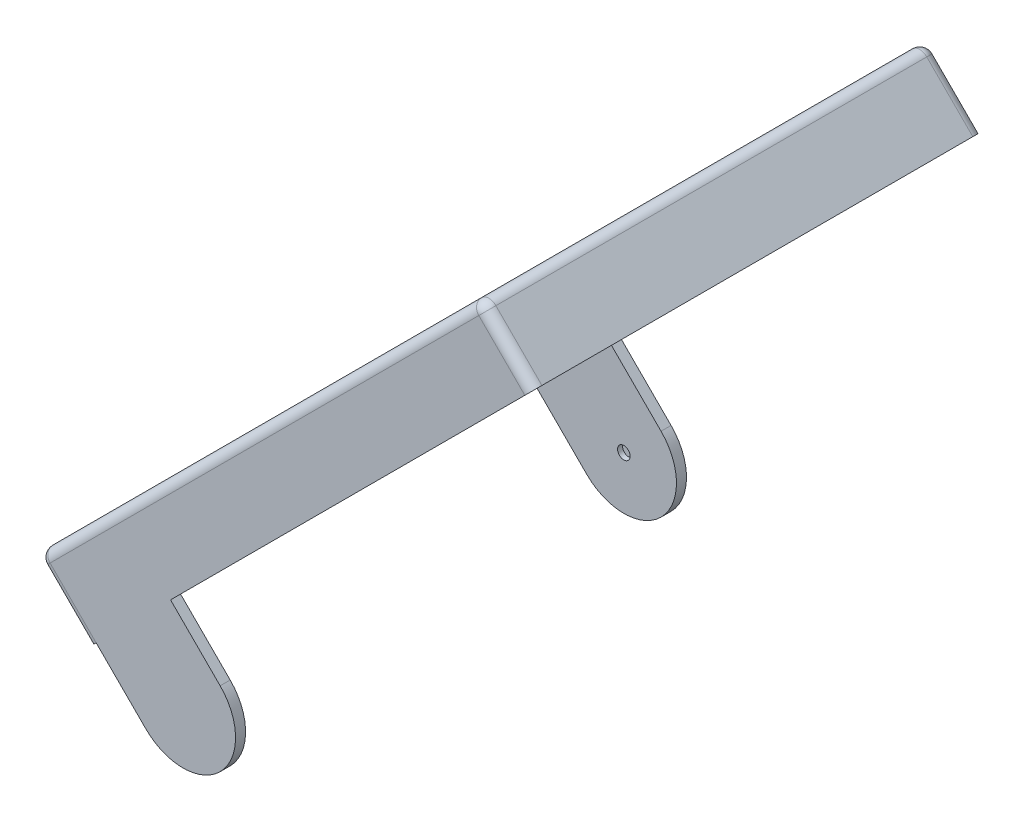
ISO-10303-21;
HEADER;
FILE_DESCRIPTION(('STEP AP214'),'2;1');
FILE_NAME('part.step','',(''),(''),'','','');
FILE_SCHEMA(('AUTOMOTIVE_DESIGN { 1 0 10303 214 1 1 1 1 }'));
ENDSEC;
DATA;
#1=APPLICATION_CONTEXT('core data for automotive mechanical design processes');
#2=APPLICATION_PROTOCOL_DEFINITION('international standard','automotive_design',2000,#1);
#3=PRODUCT_CONTEXT('',#1,'mechanical');
#4=PRODUCT('Part','Part','',(#3));
#5=PRODUCT_RELATED_PRODUCT_CATEGORY('part','',(#4));
#6=PRODUCT_DEFINITION_FORMATION('','',#4);
#7=PRODUCT_DEFINITION_CONTEXT('part definition',#1,'design');
#8=PRODUCT_DEFINITION('design','',#6,#7);
#9=PRODUCT_DEFINITION_SHAPE('','',#8);
#10=(LENGTH_UNIT() NAMED_UNIT(*) SI_UNIT(.MILLI.,.METRE.));
#11=(NAMED_UNIT(*) PLANE_ANGLE_UNIT() SI_UNIT($,.RADIAN.));
#12=(NAMED_UNIT(*) SI_UNIT($,.STERADIAN.) SOLID_ANGLE_UNIT());
#13=UNCERTAINTY_MEASURE_WITH_UNIT(LENGTH_MEASURE(1.E-05),#10,'distance_accuracy_value','');
#14=(GEOMETRIC_REPRESENTATION_CONTEXT(3) GLOBAL_UNCERTAINTY_ASSIGNED_CONTEXT((#13)) GLOBAL_UNIT_ASSIGNED_CONTEXT((#10,
#11,#12)) REPRESENTATION_CONTEXT('',''));
#15=CARTESIAN_POINT('',(0.,0.,0.));
#16=DIRECTION('',(0.,0.,1.));
#17=DIRECTION('',(1.,0.,0.));
#18=AXIS2_PLACEMENT_3D('',#15,#16,#17);
#19=CARTESIAN_POINT('',(20.6500179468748,105.449007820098,-45.));
#20=DIRECTION('',(-0.707106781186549,0.707106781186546,0.));
#21=DIRECTION('',(0.,0.,1.));
#22=AXIS2_PLACEMENT_3D('',#19,#20,#21);
#23=PLANE('',#22);
#24=DIRECTION('',(0.,0.,-1.));
#25=VECTOR('',#24,1.);
#26=CARTESIAN_POINT('',(-66.3241161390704,18.4748737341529,-43.));
#27=LINE('',#26,#25);
#28=CARTESIAN_POINT('',(-66.3241161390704,18.4748737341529,-43.));
#29=VERTEX_POINT('',#28);
#30=CARTESIAN_POINT('',(-66.3241161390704,18.4748737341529,-45.));
#31=VERTEX_POINT('',#30);
#32=EDGE_CURVE('E246',#29,#31,#27,.T.);
#33=ORIENTED_EDGE('',*,*,#32,.F.);
#34=DIRECTION('',(0.,0.,1.));
#35=VECTOR('',#34,1.);
#36=CARTESIAN_POINT('',(-66.3241161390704,18.4748737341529,45.));
#37=LINE('',#36,#35);
#38=CARTESIAN_POINT('',(-66.3241161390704,18.4748737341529,43.));
#39=VERTEX_POINT('',#38);
#40=EDGE_CURVE('E311',#29,#39,#37,.T.);
#41=ORIENTED_EDGE('',*,*,#40,.T.);
#42=DIRECTION('',(0.,0.,1.));
#43=VECTOR('',#42,1.);
#44=CARTESIAN_POINT('',(-66.3241161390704,18.4748737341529,43.));
#45=LINE('',#44,#43);
#46=CARTESIAN_POINT('',(-66.3241161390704,18.4748737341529,45.));
#47=VERTEX_POINT('',#46);
#48=EDGE_CURVE('E289',#39,#47,#45,.T.);
#49=ORIENTED_EDGE('',*,*,#48,.T.);
#50=CARTESIAN_POINT('',(-66.3241161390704,18.4748737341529,43.));
#51=DIRECTION('',(-0.707106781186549,0.707106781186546,0.));
#52=DIRECTION('',(0.,0.,1.));
#53=AXIS2_PLACEMENT_3D('',#50,#51,#52);
#54=CIRCLE('',#53,2.);
#55=CARTESIAN_POINT('',(-67.7383297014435,17.0606601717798,43.));
#56=VERTEX_POINT('',#55);
#57=EDGE_CURVE('E360',#47,#56,#54,.F.);
#58=ORIENTED_EDGE('',*,*,#57,.T.);
#59=DIRECTION('',(0.,0.,1.));
#60=VECTOR('',#59,1.);
#61=CARTESIAN_POINT('',(-67.7383297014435,17.0606601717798,45.));
#62=LINE('',#61,#60);
#63=CARTESIAN_POINT('',(-67.7383297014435,17.0606601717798,-43.));
#64=VERTEX_POINT('',#63);
#65=EDGE_CURVE('E343',#64,#56,#62,.T.);
#66=ORIENTED_EDGE('',*,*,#65,.F.);
#67=CARTESIAN_POINT('',(-66.3241161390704,18.4748737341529,-43.));
#68=DIRECTION('',(-0.707106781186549,0.707106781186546,0.));
#69=DIRECTION('',(0.,0.,1.));
#70=AXIS2_PLACEMENT_3D('',#67,#68,#69);
#71=CIRCLE('',#70,2.);
#72=EDGE_CURVE('E362',#64,#31,#71,.F.);
#73=ORIENTED_EDGE('',*,*,#72,.T.);
#74=EDGE_LOOP('',(#33,#41,#49,#58,#66,#73));
#75=FACE_BOUND('',#74,.T.);
#76=ADVANCED_FACE('F34',(#75),#23,.F.);
#77=DIRECTION('',(0.,0.,-1.));
#78=VECTOR('',#77,1.);
#79=CARTESIAN_POINT('',(-51.4748737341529,33.3241161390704,-43.));
#80=LINE('',#79,#78);
#81=CARTESIAN_POINT('',(-51.4748737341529,33.3241161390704,-43.));
#82=VERTEX_POINT('',#81);
#83=CARTESIAN_POINT('',(-51.4748737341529,33.3241161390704,-45.));
#84=VERTEX_POINT('',#83);
#85=EDGE_CURVE('E57',#82,#84,#80,.T.);
#86=ORIENTED_EDGE('',*,*,#85,.T.);
#87=DIRECTION('',(-0.707106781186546,-0.707106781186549,0.));
#88=VECTOR('',#87,1.);
#89=CARTESIAN_POINT('',(-67.7383297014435,17.0606601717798,-45.));
#90=LINE('',#89,#88);
#91=CARTESIAN_POINT('',(19.2358043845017,104.034794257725,-45.));
#92=VERTEX_POINT('',#91);
#93=EDGE_CURVE('E341',#92,#84,#90,.T.);
#94=ORIENTED_EDGE('',*,*,#93,.F.);
#95=CARTESIAN_POINT('',(19.2358043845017,104.034794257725,-43.));
#96=DIRECTION('',(-0.707106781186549,0.707106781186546,0.));
#97=DIRECTION('',(0.,0.,1.));
#98=AXIS2_PLACEMENT_3D('',#95,#96,#97);
#99=CIRCLE('',#98,2.);
#100=CARTESIAN_POINT('',(20.6500179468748,105.449007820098,-43.));
#101=VERTEX_POINT('',#100);
#102=EDGE_CURVE('E358',#92,#101,#99,.F.);
#103=ORIENTED_EDGE('',*,*,#102,.T.);
#104=DIRECTION('',(0.,0.,-1.));
#105=VECTOR('',#104,1.);
#106=CARTESIAN_POINT('',(20.6500179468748,105.449007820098,45.));
#107=LINE('',#106,#105);
#108=CARTESIAN_POINT('',(20.6500179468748,105.449007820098,43.));
#109=VERTEX_POINT('',#108);
#110=EDGE_CURVE('E347',#109,#101,#107,.T.);
#111=ORIENTED_EDGE('',*,*,#110,.F.);
#112=CARTESIAN_POINT('',(19.2358043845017,104.034794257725,43.));
#113=DIRECTION('',(-0.707106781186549,0.707106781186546,0.));
#114=DIRECTION('',(0.,0.,1.));
#115=AXIS2_PLACEMENT_3D('',#112,#113,#114);
#116=CIRCLE('',#115,2.);
#117=CARTESIAN_POINT('',(19.2358043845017,104.034794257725,45.));
#118=VERTEX_POINT('',#117);
#119=EDGE_CURVE('E355',#109,#118,#116,.F.);
#120=ORIENTED_EDGE('',*,*,#119,.T.);
#121=DIRECTION('',(0.707106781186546,0.707106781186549,0.));
#122=VECTOR('',#121,1.);
#123=CARTESIAN_POINT('',(-67.7383297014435,17.0606601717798,45.));
#124=LINE('',#123,#122);
#125=CARTESIAN_POINT('',(-51.4748737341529,33.3241161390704,45.));
#126=VERTEX_POINT('',#125);
#127=EDGE_CURVE('E285',#126,#118,#124,.T.);
#128=ORIENTED_EDGE('',*,*,#127,.F.);
#129=DIRECTION('',(0.,0.,1.));
#130=VECTOR('',#129,1.);
#131=CARTESIAN_POINT('',(-51.4748737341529,33.3241161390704,43.));
#132=LINE('',#131,#130);
#133=CARTESIAN_POINT('',(-51.4748737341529,33.3241161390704,43.));
#134=VERTEX_POINT('',#133);
#135=EDGE_CURVE('E281',#134,#126,#132,.T.);
#136=ORIENTED_EDGE('',*,*,#135,.F.);
#137=DIRECTION('',(0.707106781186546,0.707106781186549,0.));
#138=VECTOR('',#137,1.);
#139=CARTESIAN_POINT('',(-67.7383297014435,17.0606601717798,43.));
#140=LINE('',#139,#138);
#141=CARTESIAN_POINT('',(19.2358043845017,104.034794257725,43.));
#142=VERTEX_POINT('',#141);
#143=EDGE_CURVE('E308',#134,#142,#140,.T.);
#144=ORIENTED_EDGE('',*,*,#143,.T.);
#145=DIRECTION('',(0.,0.,-1.));
#146=VECTOR('',#145,1.);
#147=CARTESIAN_POINT('',(19.2358043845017,104.034794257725,45.));
#148=LINE('',#147,#146);
#149=CARTESIAN_POINT('',(19.2358043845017,104.034794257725,-43.));
#150=VERTEX_POINT('',#149);
#151=EDGE_CURVE('E310',#142,#150,#148,.T.);
#152=ORIENTED_EDGE('',*,*,#151,.T.);
#153=DIRECTION('',(-0.707106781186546,-0.707106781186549,0.));
#154=VECTOR('',#153,1.);
#155=CARTESIAN_POINT('',(-67.7383297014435,17.0606601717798,-43.));
#156=LINE('',#155,#154);
#157=EDGE_CURVE('E284',#150,#82,#156,.T.);
#158=ORIENTED_EDGE('',*,*,#157,.T.);
#159=EDGE_LOOP('',(#86,#94,#103,#111,#120,#128,#136,#144,#152,#158));
#160=FACE_BOUND('',#159,.T.);
#161=ADVANCED_FACE('F458',(#160),#23,.F.);
#162=CARTESIAN_POINT('',(-78.3449314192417,27.667261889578,-45.));
#163=DIRECTION('',(0.,0.,1.));
#164=DIRECTION('',(0.707106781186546,0.707106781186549,0.));
#165=AXIS2_PLACEMENT_3D('',#162,#163,#164);
#166=PLANE('',#165);
#167=DIRECTION('',(0.707106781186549,-0.707106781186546,0.));
#168=VECTOR('',#167,1.);
#169=CARTESIAN_POINT('',(-76.9307178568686,29.0814754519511,-45.));
#170=LINE('',#169,#168);
#171=CARTESIAN_POINT('',(-75.5165042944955,27.667261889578,-45.));
#172=VERTEX_POINT('',#171);
#173=EDGE_CURVE('E366',#31,#172,#170,.F.);
#174=ORIENTED_EDGE('',*,*,#173,.T.);
#175=DIRECTION('',(-0.707106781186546,-0.707106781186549,0.));
#176=VECTOR('',#175,1.);
#177=CARTESIAN_POINT('',(10.0434162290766,113.22718241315,-45.));
#178=LINE('',#177,#176);
#179=CARTESIAN_POINT('',(10.0434162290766,113.22718241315,-45.));
#180=VERTEX_POINT('',#179);
#181=EDGE_CURVE('E394',#172,#180,#178,.F.);
#182=ORIENTED_EDGE('',*,*,#181,.T.);
#183=DIRECTION('',(0.707106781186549,-0.707106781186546,0.));
#184=VECTOR('',#183,1.);
#185=CARTESIAN_POINT('',(8.62920266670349,114.641395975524,-45.));
#186=LINE('',#185,#184);
#187=EDGE_CURVE('E364',#180,#92,#186,.T.);
#188=ORIENTED_EDGE('',*,*,#187,.T.);
#189=ORIENTED_EDGE('',*,*,#93,.T.);
#190=DIRECTION('',(-0.707106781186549,0.707106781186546,0.));
#191=VECTOR('',#190,1.);
#192=CARTESIAN_POINT('',(-41.5753787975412,23.4246212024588,-45.));
#193=LINE('',#192,#191);
#194=CARTESIAN_POINT('',(-41.5753787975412,23.4246212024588,-45.));
#195=VERTEX_POINT('',#194);
#196=EDGE_CURVE('E232',#195,#84,#193,.T.);
#197=ORIENTED_EDGE('',*,*,#196,.F.);
#198=CARTESIAN_POINT('',(-49.,16.,-45.));
#199=DIRECTION('',(0.,0.,1.));
#200=DIRECTION('',(0.707106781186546,0.707106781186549,0.));
#201=AXIS2_PLACEMENT_3D('',#198,#199,#200);
#202=CIRCLE('',#201,10.5);
#203=CARTESIAN_POINT('',(-56.4246212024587,8.57537879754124,-45.));
#204=VERTEX_POINT('',#203);
#205=EDGE_CURVE('E235',#204,#195,#202,.T.);
#206=ORIENTED_EDGE('',*,*,#205,.F.);
#207=DIRECTION('',(0.707106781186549,-0.707106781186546,0.));
#208=VECTOR('',#207,1.);
#209=CARTESIAN_POINT('',(-66.3241161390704,18.4748737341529,-45.));
#210=LINE('',#209,#208);
#211=EDGE_CURVE('E237',#31,#204,#210,.T.);
#212=ORIENTED_EDGE('',*,*,#211,.F.);
#213=EDGE_LOOP('',(#174,#182,#188,#189,#197,#206,#212));
#214=FACE_BOUND('',#213,.T.);
#215=ADVANCED_FACE('F36',(#214),#166,.F.);
#216=CARTESIAN_POINT('',(-78.3449314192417,27.667261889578,45.));
#217=DIRECTION('',(0.707106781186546,0.707106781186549,0.));
#218=DIRECTION('',(0.,0.,-1.));
#219=AXIS2_PLACEMENT_3D('',#216,#217,#218);
#220=PLANE('',#219);
#221=DIRECTION('',(0.707106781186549,-0.707106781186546,0.));
#222=VECTOR('',#221,1.);
#223=CARTESIAN_POINT('',(-78.3449314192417,27.667261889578,43.));
#224=LINE('',#223,#222);
#225=CARTESIAN_POINT('',(-76.9307178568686,26.2530483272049,43.));
#226=VERTEX_POINT('',#225);
#227=EDGE_CURVE('E350',#56,#226,#224,.F.);
#228=ORIENTED_EDGE('',*,*,#227,.T.);
#229=DIRECTION('',(0.,0.,1.));
#230=VECTOR('',#229,1.);
#231=CARTESIAN_POINT('',(-76.9307178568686,26.2530483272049,-43.));
#232=LINE('',#231,#230);
#233=CARTESIAN_POINT('',(-76.9307178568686,26.2530483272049,-43.));
#234=VERTEX_POINT('',#233);
#235=EDGE_CURVE('E390',#226,#234,#232,.F.);
#236=ORIENTED_EDGE('',*,*,#235,.T.);
#237=DIRECTION('',(0.707106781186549,-0.707106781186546,0.));
#238=VECTOR('',#237,1.);
#239=CARTESIAN_POINT('',(-78.3449314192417,27.667261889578,-43.));
#240=LINE('',#239,#238);
#241=EDGE_CURVE('E353',#234,#64,#240,.T.);
#242=ORIENTED_EDGE('',*,*,#241,.T.);
#243=ORIENTED_EDGE('',*,*,#65,.T.);
#244=EDGE_LOOP('',(#228,#236,#242,#243));
#245=FACE_BOUND('',#244,.T.);
#246=ADVANCED_FACE('F435',(#245),#220,.F.);
#247=CARTESIAN_POINT('',(-78.3449314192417,27.667261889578,45.));
#248=DIRECTION('',(0.,0.,-1.));
#249=DIRECTION('',(-0.707106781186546,-0.707106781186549,0.));
#250=AXIS2_PLACEMENT_3D('',#247,#248,#249);
#251=PLANE('',#250);
#252=DIRECTION('',(0.707106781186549,-0.707106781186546,0.));
#253=VECTOR('',#252,1.);
#254=CARTESIAN_POINT('',(8.62920266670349,114.641395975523,45.));
#255=LINE('',#254,#253);
#256=CARTESIAN_POINT('',(10.0434162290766,113.22718241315,45.));
#257=VERTEX_POINT('',#256);
#258=EDGE_CURVE('E369',#118,#257,#255,.F.);
#259=ORIENTED_EDGE('',*,*,#258,.T.);
#260=DIRECTION('',(0.707106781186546,0.707106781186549,0.));
#261=VECTOR('',#260,1.);
#262=CARTESIAN_POINT('',(-75.5165042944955,27.667261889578,45.));
#263=LINE('',#262,#261);
#264=CARTESIAN_POINT('',(-75.5165042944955,27.667261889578,45.));
#265=VERTEX_POINT('',#264);
#266=EDGE_CURVE('E297',#257,#265,#263,.F.);
#267=ORIENTED_EDGE('',*,*,#266,.T.);
#268=DIRECTION('',(0.707106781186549,-0.707106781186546,0.));
#269=VECTOR('',#268,1.);
#270=CARTESIAN_POINT('',(-76.9307178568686,29.0814754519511,45.));
#271=LINE('',#270,#269);
#272=EDGE_CURVE('E371',#265,#47,#271,.T.);
#273=ORIENTED_EDGE('',*,*,#272,.T.);
#274=DIRECTION('',(0.707106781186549,-0.707106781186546,0.));
#275=VECTOR('',#274,1.);
#276=CARTESIAN_POINT('',(-66.3241161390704,18.4748737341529,45.));
#277=LINE('',#276,#275);
#278=CARTESIAN_POINT('',(-56.4246212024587,8.57537879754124,45.));
#279=VERTEX_POINT('',#278);
#280=EDGE_CURVE('E262',#47,#279,#277,.T.);
#281=ORIENTED_EDGE('',*,*,#280,.T.);
#282=CARTESIAN_POINT('',(-49.,16.,45.));
#283=DIRECTION('',(0.,0.,1.));
#284=DIRECTION('',(0.707106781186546,0.707106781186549,0.));
#285=AXIS2_PLACEMENT_3D('',#282,#283,#284);
#286=CIRCLE('',#285,10.5);
#287=CARTESIAN_POINT('',(-41.5753787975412,23.4246212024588,45.));
#288=VERTEX_POINT('',#287);
#289=EDGE_CURVE('E265',#279,#288,#286,.T.);
#290=ORIENTED_EDGE('',*,*,#289,.T.);
#291=DIRECTION('',(-0.707106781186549,0.707106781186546,0.));
#292=VECTOR('',#291,1.);
#293=CARTESIAN_POINT('',(-41.5753787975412,23.4246212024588,45.));
#294=LINE('',#293,#292);
#295=EDGE_CURVE('E268',#288,#126,#294,.T.);
#296=ORIENTED_EDGE('',*,*,#295,.T.);
#297=ORIENTED_EDGE('',*,*,#127,.T.);
#298=EDGE_LOOP('',(#259,#267,#273,#281,#290,#296,#297));
#299=FACE_BOUND('',#298,.T.);
#300=ADVANCED_FACE('F446',(#299),#251,.F.);
#301=CARTESIAN_POINT('',(10.0434162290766,116.055609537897,45.));
#302=DIRECTION('',(-0.707106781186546,-0.707106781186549,0.));
#303=DIRECTION('',(0.,0.,1.));
#304=AXIS2_PLACEMENT_3D('',#301,#302,#303);
#305=PLANE('',#304);
#306=DIRECTION('',(0.707106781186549,-0.707106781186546,0.));
#307=VECTOR('',#306,1.);
#308=CARTESIAN_POINT('',(10.0434162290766,116.055609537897,-43.));
#309=LINE('',#308,#307);
#310=CARTESIAN_POINT('',(11.4576297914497,114.641395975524,-43.));
#311=VERTEX_POINT('',#310);
#312=EDGE_CURVE('E375',#101,#311,#309,.F.);
#313=ORIENTED_EDGE('',*,*,#312,.T.);
#314=DIRECTION('',(0.,0.,-1.));
#315=VECTOR('',#314,1.);
#316=CARTESIAN_POINT('',(11.4576297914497,114.641395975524,43.));
#317=LINE('',#316,#315);
#318=CARTESIAN_POINT('',(11.4576297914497,114.641395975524,43.));
#319=VERTEX_POINT('',#318);
#320=EDGE_CURVE('E305',#311,#319,#317,.F.);
#321=ORIENTED_EDGE('',*,*,#320,.T.);
#322=DIRECTION('',(0.707106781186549,-0.707106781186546,0.));
#323=VECTOR('',#322,1.);
#324=CARTESIAN_POINT('',(10.0434162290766,116.055609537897,43.));
#325=LINE('',#324,#323);
#326=EDGE_CURVE('E373',#319,#109,#325,.T.);
#327=ORIENTED_EDGE('',*,*,#326,.T.);
#328=ORIENTED_EDGE('',*,*,#110,.T.);
#329=EDGE_LOOP('',(#313,#321,#327,#328));
#330=FACE_BOUND('',#329,.T.);
#331=ADVANCED_FACE('F400',(#330),#305,.F.);
#332=CARTESIAN_POINT('',(10.0434162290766,116.055609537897,-45.));
#333=DIRECTION('',(-0.707106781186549,0.707106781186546,0.));
#334=DIRECTION('',(0.,0.,1.));
#335=AXIS2_PLACEMENT_3D('',#332,#333,#334);
#336=PLANE('',#335);
#337=DIRECTION('',(-0.707106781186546,-0.707106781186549,0.));
#338=VECTOR('',#337,1.);
#339=CARTESIAN_POINT('',(-76.9307178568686,29.0814754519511,-43.));
#340=LINE('',#339,#338);
#341=CARTESIAN_POINT('',(8.62920266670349,114.641395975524,-43.));
#342=VERTEX_POINT('',#341);
#343=CARTESIAN_POINT('',(-76.9307178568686,29.0814754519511,-43.));
#344=VERTEX_POINT('',#343);
#345=EDGE_CURVE('E385',#342,#344,#340,.T.);
#346=ORIENTED_EDGE('',*,*,#345,.T.);
#347=DIRECTION('',(0.,0.,1.));
#348=VECTOR('',#347,1.);
#349=CARTESIAN_POINT('',(-76.9307178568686,29.0814754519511,43.));
#350=LINE('',#349,#348);
#351=CARTESIAN_POINT('',(-76.9307178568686,29.0814754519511,43.));
#352=VERTEX_POINT('',#351);
#353=EDGE_CURVE('E387',#344,#352,#350,.T.);
#354=ORIENTED_EDGE('',*,*,#353,.T.);
#355=DIRECTION('',(0.707106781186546,0.707106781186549,0.));
#356=VECTOR('',#355,1.);
#357=CARTESIAN_POINT('',(8.62920266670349,114.641395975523,43.));
#358=LINE('',#357,#356);
#359=CARTESIAN_POINT('',(8.62920266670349,114.641395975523,43.));
#360=VERTEX_POINT('',#359);
#361=EDGE_CURVE('E381',#352,#360,#358,.T.);
#362=ORIENTED_EDGE('',*,*,#361,.T.);
#363=DIRECTION('',(0.,0.,-1.));
#364=VECTOR('',#363,1.);
#365=CARTESIAN_POINT('',(8.62920266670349,114.641395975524,-43.));
#366=LINE('',#365,#364);
#367=EDGE_CURVE('E383',#360,#342,#366,.T.);
#368=ORIENTED_EDGE('',*,*,#367,.T.);
#369=EDGE_LOOP('',(#346,#354,#362,#368));
#370=FACE_BOUND('',#369,.T.);
#371=ADVANCED_FACE('F474',(#370),#336,.T.);
#372=CARTESIAN_POINT('',(-76.9307178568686,29.0814754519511,-43.));
#373=DIRECTION('',(0.707106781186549,-0.707106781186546,0.));
#374=DIRECTION('',(0.,0.,-1.));
#375=AXIS2_PLACEMENT_3D('',#372,#373,#374);
#376=CYLINDRICAL_SURFACE('',#375,2.);
#377=ORIENTED_EDGE('',*,*,#241,.F.);
#378=CARTESIAN_POINT('',(-75.5165042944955,27.667261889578,-43.));
#379=DIRECTION('',(0.707106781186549,-0.707106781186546,0.));
#380=DIRECTION('',(0.,0.,-1.));
#381=AXIS2_PLACEMENT_3D('',#378,#379,#380);
#382=CIRCLE('',#381,2.);
#383=EDGE_CURVE('E392',#234,#172,#382,.T.);
#384=ORIENTED_EDGE('',*,*,#383,.T.);
#385=ORIENTED_EDGE('',*,*,#173,.F.);
#386=ORIENTED_EDGE('',*,*,#72,.F.);
#387=EDGE_LOOP('',(#377,#384,#385,#386));
#388=FACE_BOUND('',#387,.T.);
#389=ADVANCED_FACE('F476',(#388),#376,.T.);
#390=CARTESIAN_POINT('',(-76.9307178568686,29.0814754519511,43.));
#391=DIRECTION('',(0.707106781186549,-0.707106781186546,0.));
#392=DIRECTION('',(0.,0.,-1.));
#393=AXIS2_PLACEMENT_3D('',#390,#391,#392);
#394=CYLINDRICAL_SURFACE('',#393,2.);
#395=ORIENTED_EDGE('',*,*,#272,.F.);
#396=CARTESIAN_POINT('',(-75.5165042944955,27.667261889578,43.));
#397=DIRECTION('',(0.707106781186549,-0.707106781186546,0.));
#398=DIRECTION('',(0.,0.,-1.));
#399=AXIS2_PLACEMENT_3D('',#396,#397,#398);
#400=CIRCLE('',#399,2.);
#401=EDGE_CURVE('E378',#265,#226,#400,.T.);
#402=ORIENTED_EDGE('',*,*,#401,.T.);
#403=ORIENTED_EDGE('',*,*,#227,.F.);
#404=ORIENTED_EDGE('',*,*,#57,.F.);
#405=EDGE_LOOP('',(#395,#402,#403,#404));
#406=FACE_BOUND('',#405,.T.);
#407=ADVANCED_FACE('F433',(#406),#394,.T.);
#408=CARTESIAN_POINT('',(8.62920266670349,114.641395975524,-43.));
#409=DIRECTION('',(0.707106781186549,-0.707106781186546,0.));
#410=DIRECTION('',(0.,0.,-1.));
#411=AXIS2_PLACEMENT_3D('',#408,#409,#410);
#412=CYLINDRICAL_SURFACE('',#411,2.);
#413=ORIENTED_EDGE('',*,*,#187,.F.);
#414=CARTESIAN_POINT('',(10.0434162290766,113.22718241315,-43.));
#415=DIRECTION('',(0.707106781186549,-0.707106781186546,0.));
#416=DIRECTION('',(0.,0.,-1.));
#417=AXIS2_PLACEMENT_3D('',#414,#415,#416);
#418=CIRCLE('',#417,2.);
#419=EDGE_CURVE('E396',#180,#311,#418,.T.);
#420=ORIENTED_EDGE('',*,*,#419,.T.);
#421=ORIENTED_EDGE('',*,*,#312,.F.);
#422=ORIENTED_EDGE('',*,*,#102,.F.);
#423=EDGE_LOOP('',(#413,#420,#421,#422));
#424=FACE_BOUND('',#423,.T.);
#425=ADVANCED_FACE('F463',(#424),#412,.T.);
#426=CARTESIAN_POINT('',(8.62920266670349,114.641395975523,43.));
#427=DIRECTION('',(0.707106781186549,-0.707106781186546,0.));
#428=DIRECTION('',(0.,0.,-1.));
#429=AXIS2_PLACEMENT_3D('',#426,#427,#428);
#430=CYLINDRICAL_SURFACE('',#429,2.);
#431=ORIENTED_EDGE('',*,*,#326,.F.);
#432=CARTESIAN_POINT('',(10.0434162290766,113.22718241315,43.));
#433=DIRECTION('',(0.707106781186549,-0.707106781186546,0.));
#434=DIRECTION('',(0.,0.,-1.));
#435=AXIS2_PLACEMENT_3D('',#432,#433,#434);
#436=CIRCLE('',#435,2.);
#437=EDGE_CURVE('E298',#319,#257,#436,.T.);
#438=ORIENTED_EDGE('',*,*,#437,.T.);
#439=ORIENTED_EDGE('',*,*,#258,.F.);
#440=ORIENTED_EDGE('',*,*,#119,.F.);
#441=EDGE_LOOP('',(#431,#438,#439,#440));
#442=FACE_BOUND('',#441,.T.);
#443=ADVANCED_FACE('F407',(#442),#430,.T.);
#444=CARTESIAN_POINT('',(10.0434162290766,113.22718241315,-43.));
#445=DIRECTION('',(0.,0.,1.));
#446=DIRECTION('',(0.707106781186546,0.707106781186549,0.));
#447=AXIS2_PLACEMENT_3D('',#444,#445,#446);
#448=SPHERICAL_SURFACE('',#447,2.);
#449=CARTESIAN_POINT('',(10.0434162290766,113.22718241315,-43.));
#450=DIRECTION('',(0.,0.,1.));
#451=DIRECTION('',(0.707106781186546,0.707106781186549,0.));
#452=AXIS2_PLACEMENT_3D('',#449,#450,#451);
#453=CIRCLE('',#452,2.);
#454=EDGE_CURVE('E335',#311,#342,#453,.T.);
#455=ORIENTED_EDGE('',*,*,#454,.F.);
#456=ORIENTED_EDGE('',*,*,#419,.F.);
#457=CARTESIAN_POINT('',(10.0434162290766,113.22718241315,-43.));
#458=DIRECTION('',(-0.707106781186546,-0.707106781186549,0.));
#459=DIRECTION('',(0.,0.,1.));
#460=AXIS2_PLACEMENT_3D('',#457,#458,#459);
#461=CIRCLE('',#460,2.);
#462=EDGE_CURVE('E338',#342,#180,#461,.T.);
#463=ORIENTED_EDGE('',*,*,#462,.F.);
#464=EDGE_LOOP('',(#455,#456,#463));
#465=FACE_BOUND('',#464,.T.);
#466=ADVANCED_FACE('F467',(#465),#448,.T.);
#467=CARTESIAN_POINT('',(11.4576297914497,114.641395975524,-43.));
#468=DIRECTION('',(0.707106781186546,0.707106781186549,0.));
#469=DIRECTION('',(0.,0.,-1.));
#470=AXIS2_PLACEMENT_3D('',#467,#468,#469);
#471=CYLINDRICAL_SURFACE('',#470,2.);
#472=ORIENTED_EDGE('',*,*,#462,.T.);
#473=ORIENTED_EDGE('',*,*,#181,.F.);
#474=CARTESIAN_POINT('',(-75.5165042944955,27.667261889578,-43.));
#475=DIRECTION('',(-0.707106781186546,-0.707106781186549,0.));
#476=DIRECTION('',(0.,0.,1.));
#477=AXIS2_PLACEMENT_3D('',#474,#475,#476);
#478=CIRCLE('',#477,2.);
#479=EDGE_CURVE('E332',#344,#172,#478,.T.);
#480=ORIENTED_EDGE('',*,*,#479,.F.);
#481=ORIENTED_EDGE('',*,*,#345,.F.);
#482=EDGE_LOOP('',(#472,#473,#480,#481));
#483=FACE_BOUND('',#482,.T.);
#484=ADVANCED_FACE('F471',(#483),#471,.T.);
#485=CARTESIAN_POINT('',(10.0434162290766,113.22718241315,-45.));
#486=DIRECTION('',(0.,0.,1.));
#487=DIRECTION('',(0.707106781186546,0.707106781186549,0.));
#488=AXIS2_PLACEMENT_3D('',#485,#486,#487);
#489=CYLINDRICAL_SURFACE('',#488,2.);
#490=ORIENTED_EDGE('',*,*,#454,.T.);
#491=ORIENTED_EDGE('',*,*,#367,.F.);
#492=CARTESIAN_POINT('',(10.0434162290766,113.22718241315,43.));
#493=DIRECTION('',(0.,0.,1.));
#494=DIRECTION('',(0.707106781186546,0.707106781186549,0.));
#495=AXIS2_PLACEMENT_3D('',#492,#493,#494);
#496=CIRCLE('',#495,2.);
#497=EDGE_CURVE('E329',#319,#360,#496,.T.);
#498=ORIENTED_EDGE('',*,*,#497,.F.);
#499=ORIENTED_EDGE('',*,*,#320,.F.);
#500=EDGE_LOOP('',(#490,#491,#498,#499));
#501=FACE_BOUND('',#500,.T.);
#502=ADVANCED_FACE('F412',(#501),#489,.T.);
#503=CARTESIAN_POINT('',(-75.5165042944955,27.667261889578,-43.));
#504=DIRECTION('',(0.,0.,1.));
#505=DIRECTION('',(0.707106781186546,0.707106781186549,0.));
#506=AXIS2_PLACEMENT_3D('',#503,#504,#505);
#507=SPHERICAL_SURFACE('',#506,2.);
#508=ORIENTED_EDGE('',*,*,#479,.T.);
#509=ORIENTED_EDGE('',*,*,#383,.F.);
#510=CARTESIAN_POINT('',(-75.5165042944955,27.667261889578,-43.));
#511=DIRECTION('',(0.,0.,1.));
#512=DIRECTION('',(0.707106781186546,0.707106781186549,0.));
#513=AXIS2_PLACEMENT_3D('',#510,#511,#512);
#514=CIRCLE('',#513,2.);
#515=EDGE_CURVE('E326',#344,#234,#514,.T.);
#516=ORIENTED_EDGE('',*,*,#515,.F.);
#517=EDGE_LOOP('',(#508,#509,#516));
#518=FACE_BOUND('',#517,.T.);
#519=ADVANCED_FACE('F503',(#518),#507,.T.);
#520=CARTESIAN_POINT('',(10.0434162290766,113.22718241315,43.));
#521=DIRECTION('',(0.,0.,1.));
#522=DIRECTION('',(0.707106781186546,0.707106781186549,0.));
#523=AXIS2_PLACEMENT_3D('',#520,#521,#522);
#524=SPHERICAL_SURFACE('',#523,2.);
#525=ORIENTED_EDGE('',*,*,#437,.F.);
#526=ORIENTED_EDGE('',*,*,#497,.T.);
#527=CARTESIAN_POINT('',(10.0434162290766,113.22718241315,43.));
#528=DIRECTION('',(-0.707106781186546,-0.707106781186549,0.));
#529=DIRECTION('',(0.,0.,1.));
#530=AXIS2_PLACEMENT_3D('',#527,#528,#529);
#531=CIRCLE('',#530,2.);
#532=EDGE_CURVE('E323',#257,#360,#531,.T.);
#533=ORIENTED_EDGE('',*,*,#532,.F.);
#534=EDGE_LOOP('',(#525,#526,#533));
#535=FACE_BOUND('',#534,.T.);
#536=ADVANCED_FACE('F415',(#535),#524,.T.);
#537=CARTESIAN_POINT('',(-75.5165042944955,27.667261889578,-45.));
#538=DIRECTION('',(0.,0.,-1.));
#539=DIRECTION('',(-0.707106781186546,-0.707106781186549,0.));
#540=AXIS2_PLACEMENT_3D('',#537,#538,#539);
#541=CYLINDRICAL_SURFACE('',#540,2.);
#542=ORIENTED_EDGE('',*,*,#515,.T.);
#543=ORIENTED_EDGE('',*,*,#235,.F.);
#544=CARTESIAN_POINT('',(-75.5165042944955,27.667261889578,43.));
#545=DIRECTION('',(0.,0.,1.));
#546=DIRECTION('',(0.707106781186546,0.707106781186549,0.));
#547=AXIS2_PLACEMENT_3D('',#544,#545,#546);
#548=CIRCLE('',#547,2.);
#549=EDGE_CURVE('E320',#352,#226,#548,.T.);
#550=ORIENTED_EDGE('',*,*,#549,.F.);
#551=ORIENTED_EDGE('',*,*,#353,.F.);
#552=EDGE_LOOP('',(#542,#543,#550,#551));
#553=FACE_BOUND('',#552,.T.);
#554=ADVANCED_FACE('F427',(#553),#541,.T.);
#555=CARTESIAN_POINT('',(11.4576297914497,114.641395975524,43.));
#556=DIRECTION('',(-0.707106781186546,-0.707106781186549,0.));
#557=DIRECTION('',(0.,0.,1.));
#558=AXIS2_PLACEMENT_3D('',#555,#556,#557);
#559=CYLINDRICAL_SURFACE('',#558,2.);
#560=ORIENTED_EDGE('',*,*,#532,.T.);
#561=ORIENTED_EDGE('',*,*,#361,.F.);
#562=CARTESIAN_POINT('',(-75.5165042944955,27.667261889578,43.));
#563=DIRECTION('',(-0.707106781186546,-0.707106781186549,0.));
#564=DIRECTION('',(0.,0.,1.));
#565=AXIS2_PLACEMENT_3D('',#562,#563,#564);
#566=CIRCLE('',#565,2.);
#567=EDGE_CURVE('E318',#265,#352,#566,.T.);
#568=ORIENTED_EDGE('',*,*,#567,.F.);
#569=ORIENTED_EDGE('',*,*,#266,.F.);
#570=EDGE_LOOP('',(#560,#561,#568,#569));
#571=FACE_BOUND('',#570,.T.);
#572=ADVANCED_FACE('F419',(#571),#559,.T.);
#573=CARTESIAN_POINT('',(-75.5165042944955,27.667261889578,43.));
#574=DIRECTION('',(0.,0.,1.));
#575=DIRECTION('',(0.707106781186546,0.707106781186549,0.));
#576=AXIS2_PLACEMENT_3D('',#573,#574,#575);
#577=SPHERICAL_SURFACE('',#576,2.);
#578=ORIENTED_EDGE('',*,*,#549,.T.);
#579=ORIENTED_EDGE('',*,*,#401,.F.);
#580=ORIENTED_EDGE('',*,*,#567,.T.);
#581=EDGE_LOOP('',(#578,#579,#580));
#582=FACE_BOUND('',#581,.T.);
#583=ADVANCED_FACE('F423',(#582),#577,.T.);
#584=CARTESIAN_POINT('',(-78.3449314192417,27.667261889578,-43.));
#585=DIRECTION('',(0.,0.,1.));
#586=DIRECTION('',(0.707106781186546,0.707106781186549,0.));
#587=AXIS2_PLACEMENT_3D('',#584,#585,#586);
#588=PLANE('',#587);
#589=CARTESIAN_POINT('',(-49.,16.,-43.));
#590=DIRECTION('',(0.,0.,1.));
#591=DIRECTION('',(0.707106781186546,0.707106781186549,0.));
#592=AXIS2_PLACEMENT_3D('',#589,#590,#591);
#593=CIRCLE('',#592,1.25000000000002);
#594=CARTESIAN_POINT('',(-48.1161165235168,16.8838834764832,-43.));
#595=VERTEX_POINT('',#594);
#596=EDGE_CURVE('E223',#595,#595,#593,.T.);
#597=ORIENTED_EDGE('',*,*,#596,.F.);
#598=EDGE_LOOP('',(#597));
#599=FACE_BOUND('',#598,.T.);
#600=DIRECTION('',(-0.707106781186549,0.707106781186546,0.));
#601=VECTOR('',#600,1.);
#602=CARTESIAN_POINT('',(-76.9307178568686,29.0814754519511,-43.));
#603=LINE('',#602,#601);
#604=CARTESIAN_POINT('',(-75.5165042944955,27.667261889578,-43.));
#605=VERTEX_POINT('',#604);
#606=EDGE_CURVE('E846',#29,#605,#603,.T.);
#607=ORIENTED_EDGE('',*,*,#606,.F.);
#608=DIRECTION('',(0.707106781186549,-0.707106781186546,0.));
#609=VECTOR('',#608,1.);
#610=CARTESIAN_POINT('',(-66.3241161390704,18.4748737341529,-43.));
#611=LINE('',#610,#609);
#612=CARTESIAN_POINT('',(-56.4246212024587,8.57537879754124,-43.));
#613=VERTEX_POINT('',#612);
#614=EDGE_CURVE('E244',#29,#613,#611,.T.);
#615=ORIENTED_EDGE('',*,*,#614,.T.);
#616=CARTESIAN_POINT('',(-49.,16.,-43.));
#617=DIRECTION('',(0.,0.,1.));
#618=DIRECTION('',(0.707106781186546,0.707106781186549,0.));
#619=AXIS2_PLACEMENT_3D('',#616,#617,#618);
#620=CIRCLE('',#619,10.5);
#621=CARTESIAN_POINT('',(-41.5753787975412,23.4246212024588,-43.));
#622=VERTEX_POINT('',#621);
#623=EDGE_CURVE('E242',#613,#622,#620,.T.);
#624=ORIENTED_EDGE('',*,*,#623,.T.);
#625=DIRECTION('',(-0.707106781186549,0.707106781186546,0.));
#626=VECTOR('',#625,1.);
#627=CARTESIAN_POINT('',(-41.5753787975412,23.4246212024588,-43.));
#628=LINE('',#627,#626);
#629=EDGE_CURVE('E239',#622,#82,#628,.T.);
#630=ORIENTED_EDGE('',*,*,#629,.T.);
#631=ORIENTED_EDGE('',*,*,#157,.F.);
#632=DIRECTION('',(-0.707106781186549,0.707106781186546,0.));
#633=VECTOR('',#632,1.);
#634=CARTESIAN_POINT('',(8.62920266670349,114.641395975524,-43.));
#635=LINE('',#634,#633);
#636=CARTESIAN_POINT('',(10.0434162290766,113.22718241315,-43.));
#637=VERTEX_POINT('',#636);
#638=EDGE_CURVE('E853',#150,#637,#635,.T.);
#639=ORIENTED_EDGE('',*,*,#638,.T.);
#640=DIRECTION('',(0.707106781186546,0.707106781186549,0.));
#641=VECTOR('',#640,1.);
#642=CARTESIAN_POINT('',(11.4576297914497,114.641395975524,-43.));
#643=LINE('',#642,#641);
#644=EDGE_CURVE('E321',#605,#637,#643,.T.);
#645=ORIENTED_EDGE('',*,*,#644,.F.);
#646=EDGE_LOOP('',(#607,#615,#624,#630,#631,#639,#645));
#647=FACE_BOUND('',#646,.T.);
#648=ADVANCED_FACE('F515',(#599,#647),#588,.T.);
#649=CARTESIAN_POINT('',(-76.9307178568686,29.0814754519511,45.));
#650=DIRECTION('',(0.707106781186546,0.707106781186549,0.));
#651=DIRECTION('',(0.,0.,-1.));
#652=AXIS2_PLACEMENT_3D('',#649,#650,#651);
#653=PLANE('',#652);
#654=DIRECTION('',(-0.707106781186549,0.707106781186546,0.));
#655=VECTOR('',#654,1.);
#656=CARTESIAN_POINT('',(-76.9307178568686,29.0814754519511,43.));
#657=LINE('',#656,#655);
#658=CARTESIAN_POINT('',(-75.5165042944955,27.667261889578,43.));
#659=VERTEX_POINT('',#658);
#660=EDGE_CURVE('E851',#39,#659,#657,.T.);
#661=ORIENTED_EDGE('',*,*,#660,.F.);
#662=ORIENTED_EDGE('',*,*,#40,.F.);
#663=ORIENTED_EDGE('',*,*,#606,.T.);
#664=DIRECTION('',(0.,0.,-1.));
#665=VECTOR('',#664,1.);
#666=CARTESIAN_POINT('',(-75.5165042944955,27.667261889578,-45.));
#667=LINE('',#666,#665);
#668=EDGE_CURVE('E859',#659,#605,#667,.T.);
#669=ORIENTED_EDGE('',*,*,#668,.F.);
#670=EDGE_LOOP('',(#661,#662,#663,#669));
#671=FACE_BOUND('',#670,.T.);
#672=ADVANCED_FACE('F527',(#671),#653,.T.);
#673=CARTESIAN_POINT('',(-78.3449314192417,27.667261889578,43.));
#674=DIRECTION('',(0.,0.,-1.));
#675=DIRECTION('',(-0.707106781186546,-0.707106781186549,0.));
#676=AXIS2_PLACEMENT_3D('',#673,#674,#675);
#677=PLANE('',#676);
#678=CARTESIAN_POINT('',(-49.,16.,43.));
#679=DIRECTION('',(0.,0.,-1.));
#680=DIRECTION('',(-0.707106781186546,-0.707106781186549,0.));
#681=AXIS2_PLACEMENT_3D('',#678,#679,#680);
#682=CIRCLE('',#681,1.25000000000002);
#683=CARTESIAN_POINT('',(-49.8838834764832,15.1161165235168,43.));
#684=VERTEX_POINT('',#683);
#685=EDGE_CURVE('E249',#684,#684,#682,.T.);
#686=ORIENTED_EDGE('',*,*,#685,.F.);
#687=EDGE_LOOP('',(#686));
#688=FACE_BOUND('',#687,.T.);
#689=DIRECTION('',(-0.707106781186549,0.707106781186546,0.));
#690=VECTOR('',#689,1.);
#691=CARTESIAN_POINT('',(8.62920266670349,114.641395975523,43.));
#692=LINE('',#691,#690);
#693=CARTESIAN_POINT('',(10.0434162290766,113.22718241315,43.));
#694=VERTEX_POINT('',#693);
#695=EDGE_CURVE('E850',#142,#694,#692,.T.);
#696=ORIENTED_EDGE('',*,*,#695,.F.);
#697=ORIENTED_EDGE('',*,*,#143,.F.);
#698=DIRECTION('',(-0.707106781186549,0.707106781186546,0.));
#699=VECTOR('',#698,1.);
#700=CARTESIAN_POINT('',(-41.5753787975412,23.4246212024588,43.));
#701=LINE('',#700,#699);
#702=CARTESIAN_POINT('',(-41.5753787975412,23.4246212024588,43.));
#703=VERTEX_POINT('',#702);
#704=EDGE_CURVE('E275',#703,#134,#701,.T.);
#705=ORIENTED_EDGE('',*,*,#704,.F.);
#706=CARTESIAN_POINT('',(-49.,16.,43.));
#707=DIRECTION('',(0.,0.,1.));
#708=DIRECTION('',(0.707106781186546,0.707106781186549,0.));
#709=AXIS2_PLACEMENT_3D('',#706,#707,#708);
#710=CIRCLE('',#709,10.5);
#711=CARTESIAN_POINT('',(-56.4246212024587,8.57537879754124,43.));
#712=VERTEX_POINT('',#711);
#713=EDGE_CURVE('E272',#712,#703,#710,.T.);
#714=ORIENTED_EDGE('',*,*,#713,.F.);
#715=DIRECTION('',(0.707106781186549,-0.707106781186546,0.));
#716=VECTOR('',#715,1.);
#717=CARTESIAN_POINT('',(-66.3241161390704,18.4748737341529,43.));
#718=LINE('',#717,#716);
#719=EDGE_CURVE('E269',#39,#712,#718,.T.);
#720=ORIENTED_EDGE('',*,*,#719,.F.);
#721=ORIENTED_EDGE('',*,*,#660,.T.);
#722=DIRECTION('',(0.707106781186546,0.707106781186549,0.));
#723=VECTOR('',#722,1.);
#724=CARTESIAN_POINT('',(-76.9307178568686,26.2530483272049,43.));
#725=LINE('',#724,#723);
#726=EDGE_CURVE('E860',#659,#694,#725,.T.);
#727=ORIENTED_EDGE('',*,*,#726,.T.);
#728=EDGE_LOOP('',(#696,#697,#705,#714,#720,#721,#727));
#729=FACE_BOUND('',#728,.T.);
#730=ADVANCED_FACE('F523',(#688,#729),#677,.T.);
#731=CARTESIAN_POINT('',(8.62920266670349,114.641395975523,45.));
#732=DIRECTION('',(-0.707106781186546,-0.707106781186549,0.));
#733=DIRECTION('',(0.,0.,1.));
#734=AXIS2_PLACEMENT_3D('',#731,#732,#733);
#735=PLANE('',#734);
#736=DIRECTION('',(-0.706137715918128,0.706137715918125,-0.0523359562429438));
#737=VECTOR('',#736,1.);
#738=CARTESIAN_POINT('',(10.2081304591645,113.062468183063,2.39294569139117));
#739=LINE('',#738,#737);
#740=CARTESIAN_POINT('',(17.8215908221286,105.449007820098,2.95722333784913));
#741=VERTEX_POINT('',#740);
#742=CARTESIAN_POINT('',(15.700270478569,107.570328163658,2.8));
#743=VERTEX_POINT('',#742);
#744=EDGE_CURVE('E11',#741,#743,#739,.T.);
#745=ORIENTED_EDGE('',*,*,#744,.F.);
#746=DIRECTION('',(0.,0.,1.));
#747=VECTOR('',#746,1.);
#748=CARTESIAN_POINT('',(17.8215908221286,105.449007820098,0.));
#749=LINE('',#748,#747);
#750=CARTESIAN_POINT('',(17.8215908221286,105.449007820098,-2.95722333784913));
#751=VERTEX_POINT('',#750);
#752=EDGE_CURVE('E216',#751,#741,#749,.T.);
#753=ORIENTED_EDGE('',*,*,#752,.F.);
#754=DIRECTION('',(0.706137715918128,-0.706137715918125,-0.0523359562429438));
#755=VECTOR('',#754,1.);
#756=CARTESIAN_POINT('',(6.88205512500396,116.388543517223,-2.14643098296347));
#757=LINE('',#756,#755);
#758=CARTESIAN_POINT('',(15.700270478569,107.570328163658,-2.80000000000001));
#759=VERTEX_POINT('',#758);
#760=EDGE_CURVE('E296',#759,#751,#757,.T.);
#761=ORIENTED_EDGE('',*,*,#760,.F.);
#762=DIRECTION('',(0.,0.,-1.));
#763=VECTOR('',#762,1.);
#764=CARTESIAN_POINT('',(15.700270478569,107.570328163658,45.));
#765=LINE('',#764,#763);
#766=EDGE_CURVE('E42',#743,#759,#765,.T.);
#767=ORIENTED_EDGE('',*,*,#766,.F.);
#768=EDGE_LOOP('',(#745,#753,#761,#767));
#769=FACE_BOUND('',#768,.T.);
#770=ORIENTED_EDGE('',*,*,#638,.F.);
#771=ORIENTED_EDGE('',*,*,#151,.F.);
#772=ORIENTED_EDGE('',*,*,#695,.T.);
#773=DIRECTION('',(0.,0.,-1.));
#774=VECTOR('',#773,1.);
#775=CARTESIAN_POINT('',(10.0434162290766,113.22718241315,45.));
#776=LINE('',#775,#774);
#777=EDGE_CURVE('E862',#694,#637,#776,.T.);
#778=ORIENTED_EDGE('',*,*,#777,.T.);
#779=EDGE_LOOP('',(#770,#771,#772,#778));
#780=FACE_BOUND('',#779,.T.);
#781=ADVANCED_FACE('F519',(#769,#780),#735,.T.);
#782=CARTESIAN_POINT('',(11.4576297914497,114.641395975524,-45.));
#783=DIRECTION('',(-0.707106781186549,0.707106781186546,0.));
#784=DIRECTION('',(0.,0.,1.));
#785=AXIS2_PLACEMENT_3D('',#782,#783,#784);
#786=PLANE('',#785);
#787=ORIENTED_EDGE('',*,*,#644,.T.);
#788=ORIENTED_EDGE('',*,*,#777,.F.);
#789=ORIENTED_EDGE('',*,*,#726,.F.);
#790=ORIENTED_EDGE('',*,*,#668,.T.);
#791=EDGE_LOOP('',(#787,#788,#789,#790));
#792=FACE_BOUND('',#791,.T.);
#793=ADVANCED_FACE('F516',(#792),#786,.F.);
#794=CARTESIAN_POINT('',(-41.5753787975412,23.4246212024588,43.));
#795=DIRECTION('',(0.707106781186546,0.707106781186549,0.));
#796=DIRECTION('',(0.,0.,-1.));
#797=AXIS2_PLACEMENT_3D('',#794,#795,#796);
#798=PLANE('',#797);
#799=ORIENTED_EDGE('',*,*,#295,.F.);
#800=DIRECTION('',(0.,0.,1.));
#801=VECTOR('',#800,1.);
#802=CARTESIAN_POINT('',(-41.5753787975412,23.4246212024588,43.));
#803=LINE('',#802,#801);
#804=EDGE_CURVE('E278',#703,#288,#803,.T.);
#805=ORIENTED_EDGE('',*,*,#804,.F.);
#806=ORIENTED_EDGE('',*,*,#704,.T.);
#807=ORIENTED_EDGE('',*,*,#135,.T.);
#808=EDGE_LOOP('',(#799,#805,#806,#807));
#809=FACE_BOUND('',#808,.T.);
#810=ADVANCED_FACE('F455',(#809),#798,.T.);
#811=CARTESIAN_POINT('',(-49.,16.,43.));
#812=DIRECTION('',(0.,0.,1.));
#813=DIRECTION('',(0.707106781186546,0.707106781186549,0.));
#814=AXIS2_PLACEMENT_3D('',#811,#812,#813);
#815=CYLINDRICAL_SURFACE('',#814,10.5);
#816=ORIENTED_EDGE('',*,*,#289,.F.);
#817=DIRECTION('',(0.,0.,1.));
#818=VECTOR('',#817,1.);
#819=CARTESIAN_POINT('',(-56.4246212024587,8.57537879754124,43.));
#820=LINE('',#819,#818);
#821=EDGE_CURVE('E444',#712,#279,#820,.T.);
#822=ORIENTED_EDGE('',*,*,#821,.F.);
#823=ORIENTED_EDGE('',*,*,#713,.T.);
#824=ORIENTED_EDGE('',*,*,#804,.T.);
#825=EDGE_LOOP('',(#816,#822,#823,#824));
#826=FACE_BOUND('',#825,.T.);
#827=ADVANCED_FACE('F452',(#826),#815,.T.);
#828=CARTESIAN_POINT('',(-66.3241161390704,18.4748737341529,43.));
#829=DIRECTION('',(-0.707106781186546,-0.707106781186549,0.));
#830=DIRECTION('',(0.,0.,1.));
#831=AXIS2_PLACEMENT_3D('',#828,#829,#830);
#832=PLANE('',#831);
#833=ORIENTED_EDGE('',*,*,#280,.F.);
#834=ORIENTED_EDGE('',*,*,#48,.F.);
#835=ORIENTED_EDGE('',*,*,#719,.T.);
#836=ORIENTED_EDGE('',*,*,#821,.T.);
#837=EDGE_LOOP('',(#833,#834,#835,#836));
#838=FACE_BOUND('',#837,.T.);
#839=ADVANCED_FACE('F449',(#838),#832,.T.);
#840=CARTESIAN_POINT('',(-49.,16.,44.));
#841=DIRECTION('',(0.,0.,1.));
#842=DIRECTION('',(0.707106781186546,0.707106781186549,0.));
#843=AXIS2_PLACEMENT_3D('',#840,#841,#842);
#844=PLANE('',#843);
#845=CARTESIAN_POINT('',(-49.,16.,44.));
#846=DIRECTION('',(0.,0.,-1.));
#847=DIRECTION('',(-0.707106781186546,-0.707106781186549,0.));
#848=AXIS2_PLACEMENT_3D('',#845,#846,#847);
#849=CIRCLE('',#848,1.25000000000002);
#850=CARTESIAN_POINT('',(-49.8838834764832,15.1161165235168,44.));
#851=VERTEX_POINT('',#850);
#852=EDGE_CURVE('E259',#851,#851,#849,.T.);
#853=ORIENTED_EDGE('',*,*,#852,.T.);
#854=EDGE_LOOP('',(#853));
#855=FACE_BOUND('',#854,.T.);
#856=ADVANCED_FACE('F537',(#855),#844,.F.);
#857=CARTESIAN_POINT('',(-49.,16.,43.));
#858=DIRECTION('',(0.,0.,-1.));
#859=DIRECTION('',(-0.707106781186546,-0.707106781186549,0.));
#860=AXIS2_PLACEMENT_3D('',#857,#858,#859);
#861=CYLINDRICAL_SURFACE('',#860,1.25000000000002);
#862=ORIENTED_EDGE('',*,*,#852,.F.);
#863=EDGE_LOOP('',(#862));
#864=FACE_BOUND('',#863,.T.);
#865=ORIENTED_EDGE('',*,*,#685,.T.);
#866=EDGE_LOOP('',(#865));
#867=FACE_BOUND('',#866,.T.);
#868=ADVANCED_FACE('F544',(#864,#867),#861,.F.);
#869=CARTESIAN_POINT('',(-66.3241161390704,18.4748737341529,-43.));
#870=DIRECTION('',(0.707106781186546,0.707106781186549,0.));
#871=DIRECTION('',(0.,0.,-1.));
#872=AXIS2_PLACEMENT_3D('',#869,#870,#871);
#873=PLANE('',#872);
#874=ORIENTED_EDGE('',*,*,#211,.T.);
#875=DIRECTION('',(0.,0.,-1.));
#876=VECTOR('',#875,1.);
#877=CARTESIAN_POINT('',(-56.4246212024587,8.57537879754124,-43.));
#878=LINE('',#877,#876);
#879=EDGE_CURVE('E250',#613,#204,#878,.T.);
#880=ORIENTED_EDGE('',*,*,#879,.F.);
#881=ORIENTED_EDGE('',*,*,#614,.F.);
#882=ORIENTED_EDGE('',*,*,#32,.T.);
#883=EDGE_LOOP('',(#874,#880,#881,#882));
#884=FACE_BOUND('',#883,.T.);
#885=ADVANCED_FACE('F548',(#884),#873,.F.);
#886=CARTESIAN_POINT('',(-49.,16.,-43.));
#887=DIRECTION('',(0.,0.,-1.));
#888=DIRECTION('',(-0.707106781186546,-0.707106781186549,0.));
#889=AXIS2_PLACEMENT_3D('',#886,#887,#888);
#890=CYLINDRICAL_SURFACE('',#889,10.5);
#891=ORIENTED_EDGE('',*,*,#205,.T.);
#892=DIRECTION('',(0.,0.,-1.));
#893=VECTOR('',#892,1.);
#894=CARTESIAN_POINT('',(-41.5753787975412,23.4246212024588,-43.));
#895=LINE('',#894,#893);
#896=EDGE_CURVE('E253',#622,#195,#895,.T.);
#897=ORIENTED_EDGE('',*,*,#896,.F.);
#898=ORIENTED_EDGE('',*,*,#623,.F.);
#899=ORIENTED_EDGE('',*,*,#879,.T.);
#900=EDGE_LOOP('',(#891,#897,#898,#899));
#901=FACE_BOUND('',#900,.T.);
#902=ADVANCED_FACE('F554',(#901),#890,.T.);
#903=CARTESIAN_POINT('',(-41.5753787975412,23.4246212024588,-43.));
#904=DIRECTION('',(-0.707106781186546,-0.707106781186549,0.));
#905=DIRECTION('',(0.,0.,1.));
#906=AXIS2_PLACEMENT_3D('',#903,#904,#905);
#907=PLANE('',#906);
#908=ORIENTED_EDGE('',*,*,#196,.T.);
#909=ORIENTED_EDGE('',*,*,#85,.F.);
#910=ORIENTED_EDGE('',*,*,#629,.F.);
#911=ORIENTED_EDGE('',*,*,#896,.T.);
#912=EDGE_LOOP('',(#908,#909,#910,#911));
#913=FACE_BOUND('',#912,.T.);
#914=ADVANCED_FACE('F550',(#913),#907,.F.);
#915=CARTESIAN_POINT('',(-49.,16.,-44.));
#916=DIRECTION('',(0.,0.,-1.));
#917=DIRECTION('',(-0.707106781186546,-0.707106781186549,0.));
#918=AXIS2_PLACEMENT_3D('',#915,#916,#917);
#919=PLANE('',#918);
#920=CARTESIAN_POINT('',(-49.,16.,-44.));
#921=DIRECTION('',(0.,0.,1.));
#922=DIRECTION('',(0.707106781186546,0.707106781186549,0.));
#923=AXIS2_PLACEMENT_3D('',#920,#921,#922);
#924=CIRCLE('',#923,1.25000000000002);
#925=CARTESIAN_POINT('',(-48.1161165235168,16.8838834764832,-44.));
#926=VERTEX_POINT('',#925);
#927=EDGE_CURVE('E229',#926,#926,#924,.T.);
#928=ORIENTED_EDGE('',*,*,#927,.T.);
#929=EDGE_LOOP('',(#928));
#930=FACE_BOUND('',#929,.T.);
#931=ADVANCED_FACE('F553',(#930),#919,.F.);
#932=CARTESIAN_POINT('',(-49.,16.,-43.));
#933=DIRECTION('',(0.,0.,1.));
#934=DIRECTION('',(0.707106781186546,0.707106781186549,0.));
#935=AXIS2_PLACEMENT_3D('',#932,#933,#934);
#936=CYLINDRICAL_SURFACE('',#935,1.25000000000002);
#937=ORIENTED_EDGE('',*,*,#927,.F.);
#938=EDGE_LOOP('',(#937));
#939=FACE_BOUND('',#938,.T.);
#940=ORIENTED_EDGE('',*,*,#596,.T.);
#941=EDGE_LOOP('',(#940));
#942=FACE_BOUND('',#941,.T.);
#943=ADVANCED_FACE('F564',(#939,#942),#936,.F.);
#944=CARTESIAN_POINT('',(17.8215908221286,105.449007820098,0.));
#945=DIRECTION('',(0.707106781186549,-0.707106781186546,0.));
#946=DIRECTION('',(-0.707106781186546,-0.707106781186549,0.));
#947=AXIS2_PLACEMENT_3D('',#944,#945,#946);
#948=PLANE('',#947);
#949=ORIENTED_EDGE('',*,*,#752,.T.);
#950=DIRECTION('',(0.707106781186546,0.707106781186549,0.));
#951=VECTOR('',#950,1.);
#952=CARTESIAN_POINT('',(17.644814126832,105.272231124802,2.95722333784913));
#953=LINE('',#952,#951);
#954=CARTESIAN_POINT('',(18.8822509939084,106.509667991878,2.95722333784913));
#955=VERTEX_POINT('',#954);
#956=EDGE_CURVE('E221',#741,#955,#953,.T.);
#957=ORIENTED_EDGE('',*,*,#956,.T.);
#958=DIRECTION('',(0.,0.,-1.));
#959=VECTOR('',#958,1.);
#960=CARTESIAN_POINT('',(18.8822509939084,106.509667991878,0.));
#961=LINE('',#960,#959);
#962=CARTESIAN_POINT('',(18.8822509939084,106.509667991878,-2.95722333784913));
#963=VERTEX_POINT('',#962);
#964=EDGE_CURVE('E224',#955,#963,#961,.T.);
#965=ORIENTED_EDGE('',*,*,#964,.T.);
#966=DIRECTION('',(-0.707106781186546,-0.707106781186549,0.));
#967=VECTOR('',#966,1.);
#968=CARTESIAN_POINT('',(17.644814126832,105.272231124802,-2.95722333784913));
#969=LINE('',#968,#967);
#970=EDGE_CURVE('E207',#963,#751,#969,.T.);
#971=ORIENTED_EDGE('',*,*,#970,.T.);
#972=EDGE_LOOP('',(#949,#957,#965,#971));
#973=FACE_BOUND('',#972,.T.);
#974=ADVANCED_FACE('F568',(#973),#948,.F.);
#975=CARTESIAN_POINT('',(15.5234937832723,107.393551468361,2.8));
#976=DIRECTION('',(-0.0370071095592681,0.0370071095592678,0.998629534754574));
#977=DIRECTION('',(0.706137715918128,-0.706137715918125,0.0523359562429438));
#978=AXIS2_PLACEMENT_3D('',#975,#976,#977);
#979=PLANE('',#978);
#980=ORIENTED_EDGE('',*,*,#744,.T.);
#981=DIRECTION('',(-0.707106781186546,-0.707106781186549,0.));
#982=VECTOR('',#981,1.);
#983=CARTESIAN_POINT('',(15.5234937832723,107.393551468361,2.8));
#984=LINE('',#983,#982);
#985=CARTESIAN_POINT('',(16.7609306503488,108.630988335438,2.8));
#986=VERTEX_POINT('',#985);
#987=EDGE_CURVE('E214',#986,#743,#984,.T.);
#988=ORIENTED_EDGE('',*,*,#987,.F.);
#989=DIRECTION('',(0.706137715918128,-0.706137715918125,0.0523359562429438));
#990=VECTOR('',#989,1.);
#991=CARTESIAN_POINT('',(16.6574527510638,108.734466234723,2.79233065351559));
#992=LINE('',#991,#990);
#993=EDGE_CURVE('E210',#986,#955,#992,.T.);
#994=ORIENTED_EDGE('',*,*,#993,.T.);
#995=ORIENTED_EDGE('',*,*,#956,.F.);
#996=EDGE_LOOP('',(#980,#988,#994,#995));
#997=FACE_BOUND('',#996,.T.);
#998=ADVANCED_FACE('F572',(#997),#979,.F.);
#999=CARTESIAN_POINT('',(16.7609306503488,108.630988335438,0.));
#1000=DIRECTION('',(0.707106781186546,0.707106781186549,0.));
#1001=DIRECTION('',(0.707106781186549,-0.707106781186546,0.));
#1002=AXIS2_PLACEMENT_3D('',#999,#1000,#1001);
#1003=PLANE('',#1002);
#1004=ORIENTED_EDGE('',*,*,#993,.F.);
#1005=DIRECTION('',(0.,0.,1.));
#1006=VECTOR('',#1005,1.);
#1007=CARTESIAN_POINT('',(16.7609306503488,108.630988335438,0.));
#1008=LINE('',#1007,#1006);
#1009=CARTESIAN_POINT('',(16.7609306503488,108.630988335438,-2.8));
#1010=VERTEX_POINT('',#1009);
#1011=EDGE_CURVE('E197',#1010,#986,#1008,.T.);
#1012=ORIENTED_EDGE('',*,*,#1011,.F.);
#1013=DIRECTION('',(0.706137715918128,-0.706137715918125,-0.0523359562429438));
#1014=VECTOR('',#1013,1.);
#1015=CARTESIAN_POINT('',(16.7609306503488,108.630988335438,-2.8));
#1016=LINE('',#1015,#1014);
#1017=EDGE_CURVE('E201',#1010,#963,#1016,.T.);
#1018=ORIENTED_EDGE('',*,*,#1017,.T.);
#1019=ORIENTED_EDGE('',*,*,#964,.F.);
#1020=EDGE_LOOP('',(#1004,#1012,#1018,#1019));
#1021=FACE_BOUND('',#1020,.T.);
#1022=ADVANCED_FACE('F212',(#1021),#1003,.F.);
#1023=CARTESIAN_POINT('',(15.5234937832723,107.393551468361,0.));
#1024=DIRECTION('',(-0.707106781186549,0.707106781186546,0.));
#1025=DIRECTION('',(0.,0.,1.));
#1026=AXIS2_PLACEMENT_3D('',#1023,#1024,#1025);
#1027=PLANE('',#1026);
#1028=ORIENTED_EDGE('',*,*,#766,.T.);
#1029=DIRECTION('',(0.707106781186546,0.707106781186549,0.));
#1030=VECTOR('',#1029,1.);
#1031=CARTESIAN_POINT('',(15.5234937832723,107.393551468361,-2.8));
#1032=LINE('',#1031,#1030);
#1033=EDGE_CURVE('E49',#759,#1010,#1032,.T.);
#1034=ORIENTED_EDGE('',*,*,#1033,.T.);
#1035=ORIENTED_EDGE('',*,*,#1011,.T.);
#1036=ORIENTED_EDGE('',*,*,#987,.T.);
#1037=EDGE_LOOP('',(#1028,#1034,#1035,#1036));
#1038=FACE_BOUND('',#1037,.T.);
#1039=ADVANCED_FACE('F194',(#1038),#1027,.F.);
#1040=CARTESIAN_POINT('',(15.5234937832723,107.393551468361,-2.8));
#1041=DIRECTION('',(-0.0370071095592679,0.037007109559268,-0.998629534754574));
#1042=DIRECTION('',(-0.706137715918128,0.706137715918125,0.0523359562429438));
#1043=AXIS2_PLACEMENT_3D('',#1040,#1041,#1042);
#1044=PLANE('',#1043);
#1045=ORIENTED_EDGE('',*,*,#760,.T.);
#1046=ORIENTED_EDGE('',*,*,#970,.F.);
#1047=ORIENTED_EDGE('',*,*,#1017,.F.);
#1048=ORIENTED_EDGE('',*,*,#1033,.F.);
#1049=EDGE_LOOP('',(#1045,#1046,#1047,#1048));
#1050=FACE_BOUND('',#1049,.T.);
#1051=ADVANCED_FACE('F205',(#1050),#1044,.F.);
#1052=CLOSED_SHELL('',(#76,#161,#215,#246,#300,#331,#371,#389,#407,#425,#443,#466,#484,#502,
#519,#536,#554,#572,#583,#648,#672,#730,#781,#793,#810,#827,#839,#856,#868,#885,#902,#914,#931,
#943,#974,#998,#1022,#1039,#1051));
#1053=MANIFOLD_SOLID_BREP('B2',#1052);
#1054=ADVANCED_BREP_SHAPE_REPRESENTATION('',(#18,#1053),#14);
#1055=SHAPE_DEFINITION_REPRESENTATION(#9,#1054);
ENDSEC;
END-ISO-10303-21;
